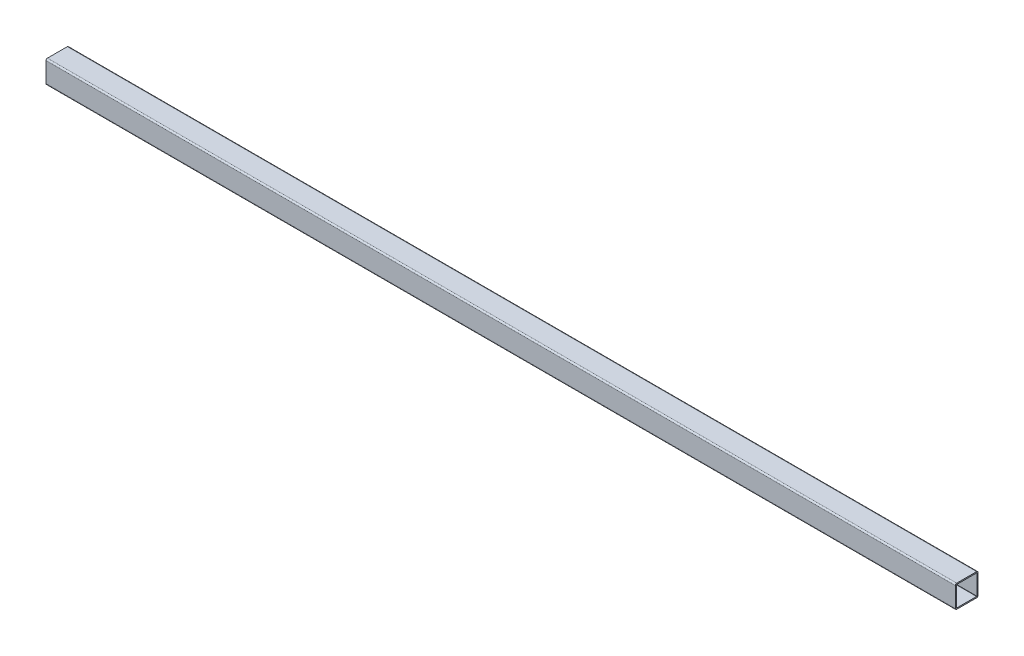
from build123d import *

# Parameters (mm, degrees)
EXTRUDE1_DEPTH = 1016


with BuildPart() as part:
    # Sketch1 → Extrude1 (new body)
    with BuildSketch(Plane(origin=(0, 0, 0), x_dir=(0, 0, -1), z_dir=(1, 0, 0))):
        with BuildLine():
            Line((-5.373037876, 5.244240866), (16.851962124, 5.244240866))
            ThreePointArc((16.851962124, 5.244240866), (17.974494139, 4.779272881), (18.439462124, 3.656740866))
            Line((18.439462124, 3.656740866), (18.439462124, -18.568259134))
            ThreePointArc((18.439462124, -18.568259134), (17.974494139, -19.690791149), (16.851962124, -20.155759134))
            Line((16.851962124, -20.155759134), (-5.373037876, -20.155759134))
            ThreePointArc((-5.373037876, -20.155759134), (-6.495569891, -19.690791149), (-6.960537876, -18.568259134))
            Line((-6.960537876, -18.568259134), (-6.960537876, 3.656740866))
            ThreePointArc((-6.960537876, 3.656740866), (-6.495569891, 4.779272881), (-5.373037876, 5.244240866))
        make_face()
        with BuildLine():
            Line((-5.373037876, 3.898040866), (16.851962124, 3.898040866))
            ThreePointArc((16.851962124, 3.898040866), (17.02258699, 3.827365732), (17.093262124, 3.656740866))
            Line((17.093262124, 3.656740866), (17.093262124, -18.568259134))
            ThreePointArc((17.093262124, -18.568259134), (17.02258699, -18.738884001), (16.851962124, -18.809559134))
            Line((16.851962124, -18.809559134), (-5.373037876, -18.809559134))
            ThreePointArc((-5.373037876, -18.809559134), (-5.543662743, -18.738884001), (-5.614337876, -18.568259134))
            Line((-5.614337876, -18.568259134), (-5.614337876, 3.656740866))
            ThreePointArc((-5.614337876, 3.656740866), (-5.543662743, 3.827365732), (-5.373037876, 3.898040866))
        make_face(mode=Mode.SUBTRACT)
    extrude(amount=EXTRUDE1_DEPTH)


solid = part.part
